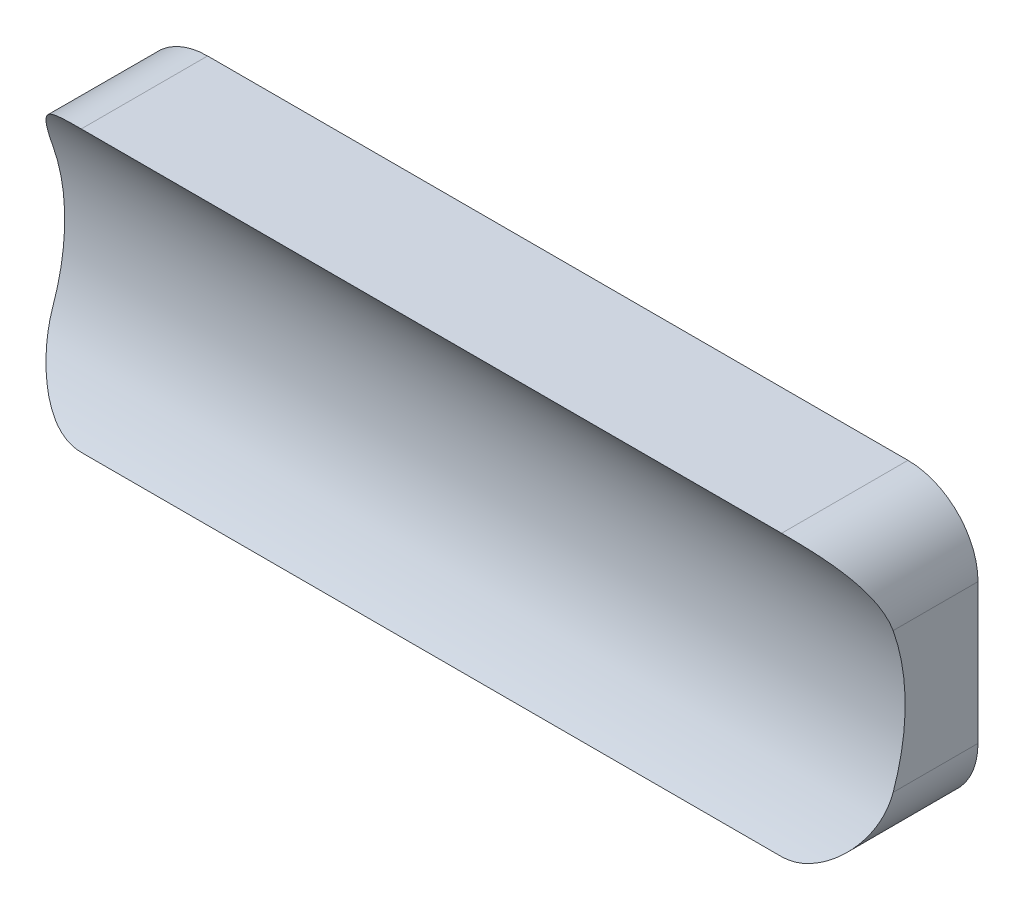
from build123d import *

# Parameters (mm, degrees)
SKETCH1_W          = 8.255
SKETCH1_H          = 12.7
EXTRUDE1_DEPTH     = 19.05
SKETCH2_R          = 9.525
CUT_EXTRUDE1_DEPTH = 38.1
FILLET1_R          = 3.175


with BuildPart() as part:
    # Sketch1 → Extrude1 (new, symmetric)
    with BuildSketch(Plane(origin=(0, 0, 0), x_dir=(0, 0, -1), z_dir=(1, 0, 0))):
        with Locations((-4.1275, 0)):
            Rectangle(SKETCH1_W, SKETCH1_H)
    extrude(amount=EXTRUDE1_DEPTH, both=True)

    # Sketch2 → Cut-Extrude1 (cut)
    with BuildSketch(Plane.ZY.offset(19.05)):
        with Locations((12.827, 0)):
            Circle(SKETCH2_R)
    extrude(amount=-CUT_EXTRUDE1_DEPTH, mode=Mode.SUBTRACT)

    # Fillet1
    fillet1_edges = [part.edges().sort_by_distance(p)[0] for p in [
        (19.05, 6.35, 2.863742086),
        (-19.05, -6.35, 2.863742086),
        (19.05, -6.35, 2.863742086),
        (-19.05, 6.35, 2.863742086),
    ]]
    fillet(fillet1_edges, radius=FILLET1_R)


solid = part.part
